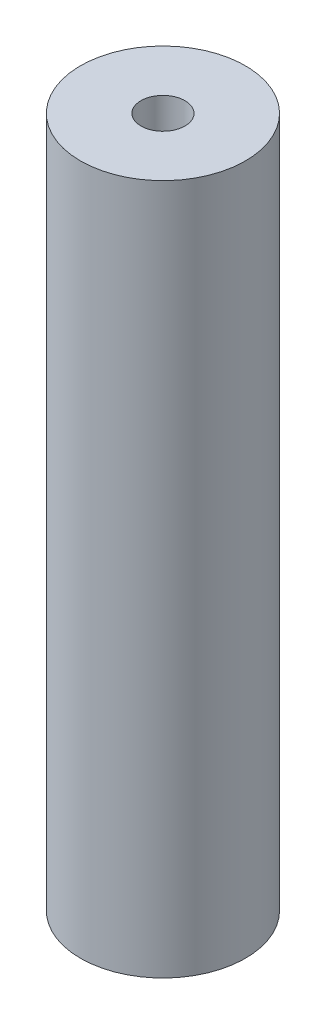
ISO-10303-21;
HEADER;
FILE_DESCRIPTION(('STEP AP214'),'2;1');
FILE_NAME('part.step','',(''),(''),'','','');
FILE_SCHEMA(('AUTOMOTIVE_DESIGN { 1 0 10303 214 1 1 1 1 }'));
ENDSEC;
DATA;
#1=APPLICATION_CONTEXT('core data for automotive mechanical design processes');
#2=APPLICATION_PROTOCOL_DEFINITION('international standard','automotive_design',2000,#1);
#3=PRODUCT_CONTEXT('',#1,'mechanical');
#4=PRODUCT('Part','Part','',(#3));
#5=PRODUCT_RELATED_PRODUCT_CATEGORY('part','',(#4));
#6=PRODUCT_DEFINITION_FORMATION('','',#4);
#7=PRODUCT_DEFINITION_CONTEXT('part definition',#1,'design');
#8=PRODUCT_DEFINITION('design','',#6,#7);
#9=PRODUCT_DEFINITION_SHAPE('','',#8);
#10=(LENGTH_UNIT() NAMED_UNIT(*) SI_UNIT(.MILLI.,.METRE.));
#11=(NAMED_UNIT(*) PLANE_ANGLE_UNIT() SI_UNIT($,.RADIAN.));
#12=(NAMED_UNIT(*) SI_UNIT($,.STERADIAN.) SOLID_ANGLE_UNIT());
#13=UNCERTAINTY_MEASURE_WITH_UNIT(LENGTH_MEASURE(1.E-05),#10,'distance_accuracy_value','');
#14=(GEOMETRIC_REPRESENTATION_CONTEXT(3) GLOBAL_UNCERTAINTY_ASSIGNED_CONTEXT((#13)) GLOBAL_UNIT_ASSIGNED_CONTEXT((#10,
#11,#12)) REPRESENTATION_CONTEXT('',''));
#15=CARTESIAN_POINT('',(0.,0.,0.));
#16=DIRECTION('',(0.,0.,1.));
#17=DIRECTION('',(1.,0.,0.));
#18=AXIS2_PLACEMENT_3D('',#15,#16,#17);
#19=CARTESIAN_POINT('',(0.,39.878,0.));
#20=DIRECTION('',(0.,-1.,0.));
#21=DIRECTION('',(0.,0.,-1.));
#22=AXIS2_PLACEMENT_3D('',#19,#20,#21);
#23=CYLINDRICAL_SURFACE('',#22,4.7625);
#24=CARTESIAN_POINT('',(0.,39.878,0.));
#25=DIRECTION('',(0.,1.,0.));
#26=DIRECTION('',(0.,0.,1.));
#27=AXIS2_PLACEMENT_3D('',#24,#25,#26);
#28=CIRCLE('',#27,4.7625);
#29=CARTESIAN_POINT('',(0.,39.878,4.7625));
#30=VERTEX_POINT('',#29);
#31=EDGE_CURVE('E10',#30,#30,#28,.T.);
#32=ORIENTED_EDGE('',*,*,#31,.F.);
#33=EDGE_LOOP('',(#32));
#34=FACE_BOUND('',#33,.T.);
#35=CARTESIAN_POINT('',(0.,0.,0.));
#36=DIRECTION('',(0.,1.,0.));
#37=DIRECTION('',(0.,0.,1.));
#38=AXIS2_PLACEMENT_3D('',#35,#36,#37);
#39=CIRCLE('',#38,4.7625);
#40=CARTESIAN_POINT('',(0.,0.,4.7625));
#41=VERTEX_POINT('',#40);
#42=EDGE_CURVE('E33',#41,#41,#39,.T.);
#43=ORIENTED_EDGE('',*,*,#42,.T.);
#44=EDGE_LOOP('',(#43));
#45=FACE_BOUND('',#44,.T.);
#46=ADVANCED_FACE('F30',(#34,#45),#23,.T.);
#47=CARTESIAN_POINT('',(0.,39.878,0.));
#48=DIRECTION('',(0.,1.,0.));
#49=DIRECTION('',(0.,0.,1.));
#50=AXIS2_PLACEMENT_3D('',#47,#48,#49);
#51=PLANE('',#50);
#52=CARTESIAN_POINT('',(0.,39.878,0.));
#53=DIRECTION('',(0.,1.,0.));
#54=DIRECTION('',(0.,0.,1.));
#55=AXIS2_PLACEMENT_3D('',#52,#53,#54);
#56=CIRCLE('',#55,1.27);
#57=CARTESIAN_POINT('',(0.,39.878,1.27));
#58=VERTEX_POINT('',#57);
#59=EDGE_CURVE('E42',#58,#58,#56,.T.);
#60=ORIENTED_EDGE('',*,*,#59,.F.);
#61=EDGE_LOOP('',(#60));
#62=FACE_BOUND('',#61,.T.);
#63=ORIENTED_EDGE('',*,*,#31,.T.);
#64=EDGE_LOOP('',(#63));
#65=FACE_BOUND('',#64,.T.);
#66=ADVANCED_FACE('F57',(#62,#65),#51,.T.);
#67=CARTESIAN_POINT('',(0.,0.,0.));
#68=DIRECTION('',(0.,1.,0.));
#69=DIRECTION('',(0.,0.,1.));
#70=AXIS2_PLACEMENT_3D('',#67,#68,#69);
#71=PLANE('',#70);
#72=CARTESIAN_POINT('',(0.,0.,0.));
#73=DIRECTION('',(0.,1.,0.));
#74=DIRECTION('',(0.,0.,1.));
#75=AXIS2_PLACEMENT_3D('',#72,#73,#74);
#76=CIRCLE('',#75,1.27);
#77=CARTESIAN_POINT('',(0.,0.,1.27));
#78=VERTEX_POINT('',#77);
#79=EDGE_CURVE('E40',#78,#78,#76,.T.);
#80=ORIENTED_EDGE('',*,*,#79,.T.);
#81=EDGE_LOOP('',(#80));
#82=FACE_BOUND('',#81,.T.);
#83=ORIENTED_EDGE('',*,*,#42,.F.);
#84=EDGE_LOOP('',(#83));
#85=FACE_BOUND('',#84,.T.);
#86=ADVANCED_FACE('F48',(#82,#85),#71,.F.);
#87=CARTESIAN_POINT('',(0.,0.,0.));
#88=DIRECTION('',(0.,1.,0.));
#89=DIRECTION('',(0.,0.,1.));
#90=AXIS2_PLACEMENT_3D('',#87,#88,#89);
#91=CYLINDRICAL_SURFACE('',#90,1.27);
#92=ORIENTED_EDGE('',*,*,#79,.F.);
#93=EDGE_LOOP('',(#92));
#94=FACE_BOUND('',#93,.T.);
#95=ORIENTED_EDGE('',*,*,#59,.T.);
#96=EDGE_LOOP('',(#95));
#97=FACE_BOUND('',#96,.T.);
#98=ADVANCED_FACE('F51',(#94,#97),#91,.F.);
#99=CLOSED_SHELL('',(#46,#66,#86,#98));
#100=MANIFOLD_SOLID_BREP('B2',#99);
#101=ADVANCED_BREP_SHAPE_REPRESENTATION('',(#18,#100),#14);
#102=SHAPE_DEFINITION_REPRESENTATION(#9,#101);
ENDSEC;
END-ISO-10303-21;
